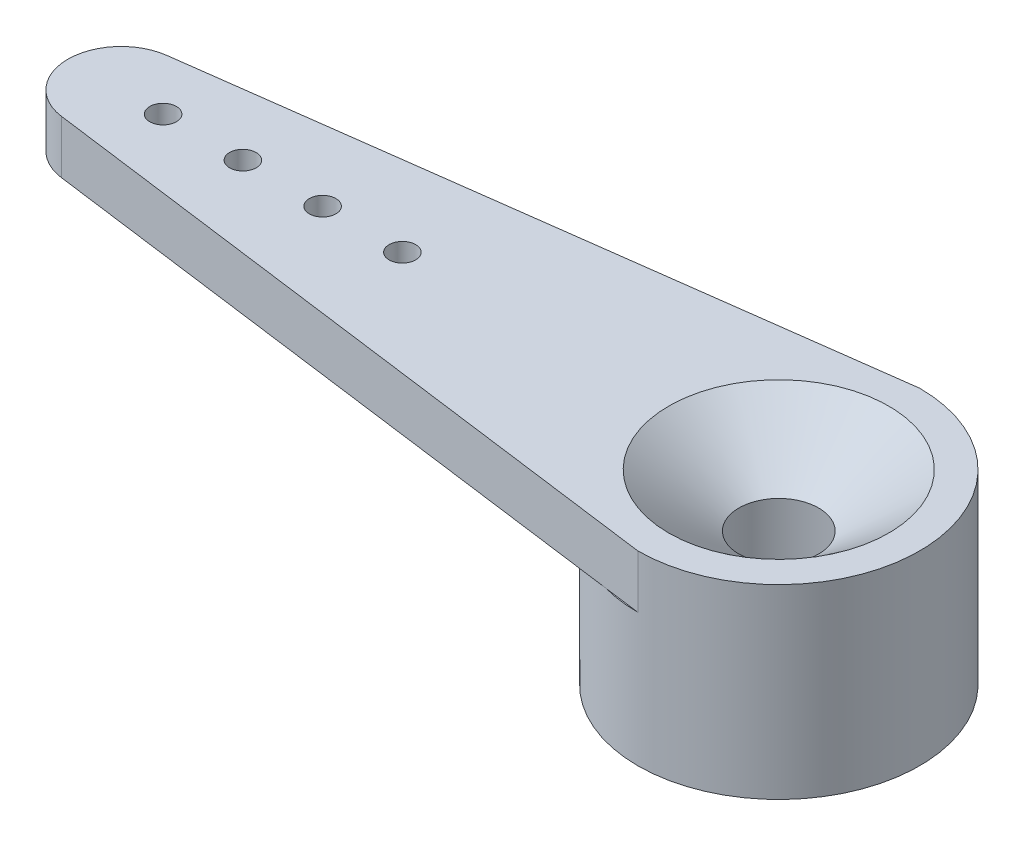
from build123d import *

# Parameters (mm, degrees)
SKETCH1_R           = 5.3
SKETCH1_R_2         = 2.8
BOSS_EXTRUDE1_DEPTH = 5
BOSS_EXTRUDE2_DEPTH = 2
SKETCH3_R           = 4.138134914
SKETCH4_R           = 1.5
CUT_EXTRUDE1_REACH  = 30.14
SKETCH5_R           = 0.5
LPATTERN1_COUNT     = 4
LPATTERN1_PITCH     = 3


with BuildPart() as part:
    # Sketch1 → Boss-Extrude1 (new body)
    with BuildSketch(Plane(origin=(0, 0, 0), x_dir=(1, 0, 0), z_dir=(0, 1, 0))):
        with Locations(Location((0, 0, 0), (0, 0, 270))):
            Circle(SKETCH1_R)
        with Locations(Location((0, 0, 0), (0, 0, 270))):
            Circle(SKETCH1_R_2, mode=Mode.SUBTRACT)
    extrude(amount=BOSS_EXTRUDE1_DEPTH)

    # Sketch2 → Boss-Extrude2 (add)
    with BuildSketch(Plane(origin=(0, 5, 0), x_dir=(1, 0, 0), z_dir=(0, 1, 0))):
        with BuildLine():
            Line((0, 5.3), (-25, 1.982419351))
            ThreePointArc((-25, 1.982419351), (-26.735399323, 0), (-25, -1.982419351))
            Line((-25, -1.982419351), (0, -5.3))
            ThreePointArc((0, -5.3), (5.3, 0), (0, 5.3))
        make_face()
    extrude(amount=BOSS_EXTRUDE2_DEPTH)

    # Sketch3 → Cut-Loft2 section 0
    with BuildSketch(Plane(origin=(0, 7, 0), x_dir=(1, 0, 0), z_dir=(0, 1, 0))):
        Circle(SKETCH3_R)
    # Sketch4 → Cut-Loft2 section 1
    with BuildSketch(Plane(origin=(0, 5, 0), x_dir=(1, 0, 0), z_dir=(0, 1, 0))):
        Circle(SKETCH4_R)
    loft(mode=Mode.SUBTRACT)

    # Sketch5 → Cut-Extrude1 (cut, up to next)
    with BuildSketch(Plane(origin=(0, 7, 0), x_dir=(1, 0, 0), z_dir=(0, 1, 0)), mode=Mode.PRIVATE) as cut_extrude1_sk1:
        with Locations(Location((-23.15575196, 0, 0), (0, 0, 270))):
            Circle(SKETCH5_R)
    cut_extrude1_tool1 = extrude(cut_extrude1_sk1.sketch, amount=-CUT_EXTRUDE1_REACH, mode=Mode.PRIVATE) & part.part
    cut_extrude1 = cut_extrude1_tool1.solids().sort_by_distance((-23.155752, 7, 0))[0]
    add(cut_extrude1, mode=Mode.SUBTRACT)

    # LPattern1: Cut-Extrude1 ×4
    with Locations(*[(i * LPATTERN1_PITCH, 0, 0) for i in range(1, LPATTERN1_COUNT)]):
        add(cut_extrude1, mode=Mode.SUBTRACT)


solid = part.part
